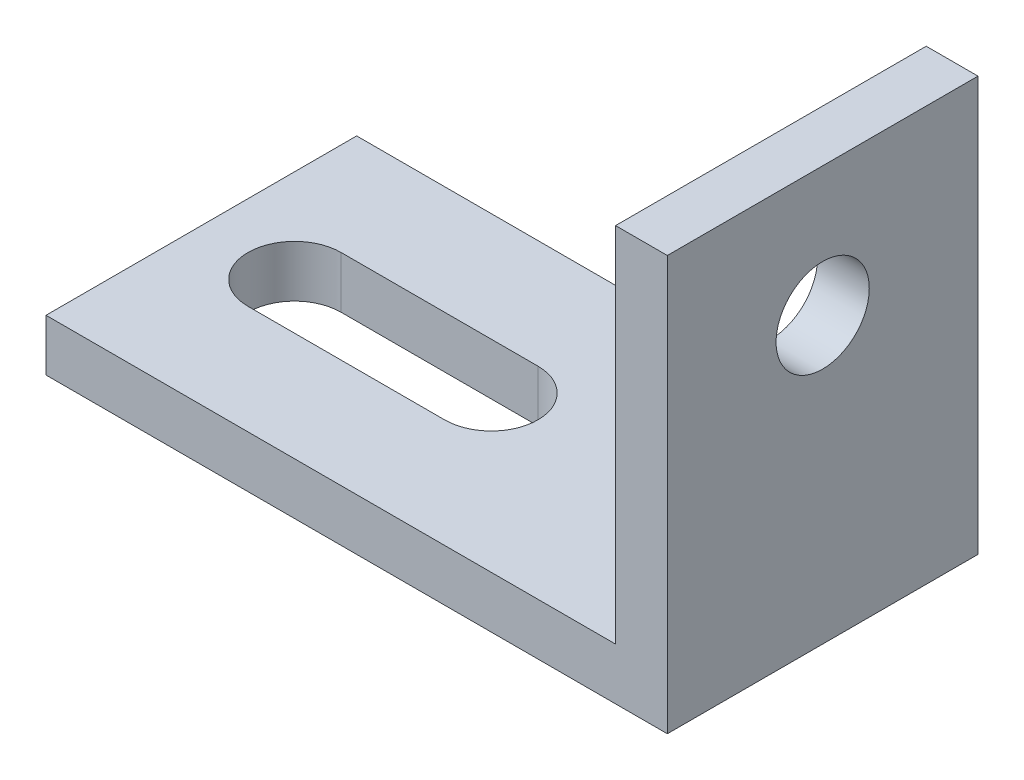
ISO-10303-21;
HEADER;
FILE_DESCRIPTION(('STEP AP214'),'2;1');
FILE_NAME('part.step','',(''),(''),'','','');
FILE_SCHEMA(('AUTOMOTIVE_DESIGN { 1 0 10303 214 1 1 1 1 }'));
ENDSEC;
DATA;
#1=APPLICATION_CONTEXT('core data for automotive mechanical design processes');
#2=APPLICATION_PROTOCOL_DEFINITION('international standard','automotive_design',2000,#1);
#3=PRODUCT_CONTEXT('',#1,'mechanical');
#4=PRODUCT('Part','Part','',(#3));
#5=PRODUCT_RELATED_PRODUCT_CATEGORY('part','',(#4));
#6=PRODUCT_DEFINITION_FORMATION('','',#4);
#7=PRODUCT_DEFINITION_CONTEXT('part definition',#1,'design');
#8=PRODUCT_DEFINITION('design','',#6,#7);
#9=PRODUCT_DEFINITION_SHAPE('','',#8);
#10=(LENGTH_UNIT() NAMED_UNIT(*) SI_UNIT(.MILLI.,.METRE.));
#11=(NAMED_UNIT(*) PLANE_ANGLE_UNIT() SI_UNIT($,.RADIAN.));
#12=(NAMED_UNIT(*) SI_UNIT($,.STERADIAN.) SOLID_ANGLE_UNIT());
#13=UNCERTAINTY_MEASURE_WITH_UNIT(LENGTH_MEASURE(1.E-05),#10,'distance_accuracy_value','');
#14=(GEOMETRIC_REPRESENTATION_CONTEXT(3) GLOBAL_UNCERTAINTY_ASSIGNED_CONTEXT((#13)) GLOBAL_UNIT_ASSIGNED_CONTEXT((#10,
#11,#12)) REPRESENTATION_CONTEXT('',''));
#15=CARTESIAN_POINT('',(0.,0.,0.));
#16=DIRECTION('',(0.,0.,1.));
#17=DIRECTION('',(1.,0.,0.));
#18=AXIS2_PLACEMENT_3D('',#15,#16,#17);
#19=CARTESIAN_POINT('',(2.5,0.,0.));
#20=DIRECTION('',(1.,0.,0.));
#21=DIRECTION('',(0.,0.,-1.));
#22=AXIS2_PLACEMENT_3D('',#19,#20,#21);
#23=CYLINDRICAL_SURFACE('',#22,4.5);
#24=CARTESIAN_POINT('',(0.,0.,0.));
#25=DIRECTION('',(1.,0.,0.));
#26=DIRECTION('',(0.,0.,-1.));
#27=AXIS2_PLACEMENT_3D('',#24,#25,#26);
#28=CIRCLE('',#27,4.5);
#29=CARTESIAN_POINT('',(0.,0.,-4.50000000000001));
#30=VERTEX_POINT('',#29);
#31=EDGE_CURVE('E18',#30,#30,#28,.F.);
#32=ORIENTED_EDGE('',*,*,#31,.T.);
#33=EDGE_LOOP('',(#32));
#34=FACE_BOUND('',#33,.T.);
#35=CARTESIAN_POINT('',(5.,0.,0.));
#36=DIRECTION('',(1.,0.,0.));
#37=DIRECTION('',(0.,0.,-1.));
#38=AXIS2_PLACEMENT_3D('',#35,#36,#37);
#39=CIRCLE('',#38,4.5);
#40=CARTESIAN_POINT('',(5.,0.,-4.50000000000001));
#41=VERTEX_POINT('',#40);
#42=EDGE_CURVE('E137',#41,#41,#39,.T.);
#43=ORIENTED_EDGE('',*,*,#42,.T.);
#44=EDGE_LOOP('',(#43));
#45=FACE_BOUND('',#44,.T.);
#46=ADVANCED_FACE('F15',(#34,#45),#23,.F.);
#47=CARTESIAN_POINT('',(2.5,12.5,0.));
#48=DIRECTION('',(0.,1.,0.));
#49=DIRECTION('',(0.,0.,1.));
#50=AXIS2_PLACEMENT_3D('',#47,#48,#49);
#51=PLANE('',#50);
#52=DIRECTION('',(-1.,0.,0.));
#53=VECTOR('',#52,1.);
#54=CARTESIAN_POINT('',(2.5,12.5,15.));
#55=LINE('',#54,#53);
#56=CARTESIAN_POINT('',(0.,12.5,15.));
#57=VERTEX_POINT('',#56);
#58=CARTESIAN_POINT('',(5.,12.5,15.));
#59=VERTEX_POINT('',#58);
#60=EDGE_CURVE('E151',#57,#59,#55,.F.);
#61=ORIENTED_EDGE('',*,*,#60,.T.);
#62=DIRECTION('',(0.,0.,1.));
#63=VECTOR('',#62,1.);
#64=CARTESIAN_POINT('',(5.,12.5,0.));
#65=LINE('',#64,#63);
#66=CARTESIAN_POINT('',(5.,12.5,-15.));
#67=VERTEX_POINT('',#66);
#68=EDGE_CURVE('E139',#59,#67,#65,.F.);
#69=ORIENTED_EDGE('',*,*,#68,.T.);
#70=DIRECTION('',(1.,0.,0.));
#71=VECTOR('',#70,1.);
#72=CARTESIAN_POINT('',(2.5,12.5,-15.));
#73=LINE('',#72,#71);
#74=CARTESIAN_POINT('',(0.,12.5,-15.));
#75=VERTEX_POINT('',#74);
#76=EDGE_CURVE('E283',#67,#75,#73,.F.);
#77=ORIENTED_EDGE('',*,*,#76,.T.);
#78=DIRECTION('',(0.,0.,-1.));
#79=VECTOR('',#78,1.);
#80=CARTESIAN_POINT('',(0.,12.5,0.));
#81=LINE('',#80,#79);
#82=EDGE_CURVE('E68',#75,#57,#81,.F.);
#83=ORIENTED_EDGE('',*,*,#82,.T.);
#84=EDGE_LOOP('',(#61,#69,#77,#83));
#85=FACE_BOUND('',#84,.T.);
#86=ADVANCED_FACE('F157',(#85),#51,.T.);
#87=CARTESIAN_POINT('',(0.,-7.5,0.));
#88=DIRECTION('',(1.,0.,0.));
#89=DIRECTION('',(0.,0.,-1.));
#90=AXIS2_PLACEMENT_3D('',#87,#88,#89);
#91=PLANE('',#90);
#92=ORIENTED_EDGE('',*,*,#31,.F.);
#93=EDGE_LOOP('',(#92));
#94=FACE_BOUND('',#93,.T.);
#95=DIRECTION('',(0.,1.,0.));
#96=VECTOR('',#95,1.);
#97=CARTESIAN_POINT('',(0.,-7.5,15.));
#98=LINE('',#97,#96);
#99=CARTESIAN_POINT('',(0.,-22.5,15.));
#100=VERTEX_POINT('',#99);
#101=EDGE_CURVE('E112',#100,#57,#98,.T.);
#102=ORIENTED_EDGE('',*,*,#101,.T.);
#103=ORIENTED_EDGE('',*,*,#82,.F.);
#104=DIRECTION('',(0.,1.,0.));
#105=VECTOR('',#104,1.);
#106=CARTESIAN_POINT('',(0.,-7.5,-15.));
#107=LINE('',#106,#105);
#108=CARTESIAN_POINT('',(0.,-22.5,-15.));
#109=VERTEX_POINT('',#108);
#110=EDGE_CURVE('E128',#75,#109,#107,.F.);
#111=ORIENTED_EDGE('',*,*,#110,.T.);
#112=DIRECTION('',(0.,0.,1.));
#113=VECTOR('',#112,1.);
#114=CARTESIAN_POINT('',(0.,-22.5,0.));
#115=LINE('',#114,#113);
#116=EDGE_CURVE('E88',#100,#109,#115,.F.);
#117=ORIENTED_EDGE('',*,*,#116,.F.);
#118=EDGE_LOOP('',(#102,#103,#111,#117));
#119=FACE_BOUND('',#118,.T.);
#120=ADVANCED_FACE('F155',(#94,#119),#91,.F.);
#121=CARTESIAN_POINT('',(-25.,-22.5,0.));
#122=DIRECTION('',(0.,1.,0.));
#123=DIRECTION('',(0.,0.,1.));
#124=AXIS2_PLACEMENT_3D('',#121,#122,#123);
#125=PLANE('',#124);
#126=CARTESIAN_POINT('',(-46.,-22.5,0.));
#127=DIRECTION('',(0.,1.,0.));
#128=DIRECTION('',(0.,0.,1.));
#129=AXIS2_PLACEMENT_3D('',#126,#127,#128);
#130=CIRCLE('',#129,4.5);
#131=CARTESIAN_POINT('',(-46.,-22.5,4.5));
#132=VERTEX_POINT('',#131);
#133=CARTESIAN_POINT('',(-46.,-22.5,-4.50000000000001));
#134=VERTEX_POINT('',#133);
#135=EDGE_CURVE('E136',#132,#134,#130,.F.);
#136=ORIENTED_EDGE('',*,*,#135,.T.);
#137=DIRECTION('',(-1.,0.,0.));
#138=VECTOR('',#137,1.);
#139=CARTESIAN_POINT('',(-46.,-22.5,-4.50000000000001));
#140=LINE('',#139,#138);
#141=CARTESIAN_POINT('',(-27.,-22.5,-4.5));
#142=VERTEX_POINT('',#141);
#143=EDGE_CURVE('E122',#134,#142,#140,.F.);
#144=ORIENTED_EDGE('',*,*,#143,.T.);
#145=CARTESIAN_POINT('',(-27.,-22.5,0.));
#146=DIRECTION('',(0.,1.,0.));
#147=DIRECTION('',(0.,0.,1.));
#148=AXIS2_PLACEMENT_3D('',#145,#146,#147);
#149=CIRCLE('',#148,4.5);
#150=CARTESIAN_POINT('',(-27.,-22.5,4.5));
#151=VERTEX_POINT('',#150);
#152=EDGE_CURVE('E134',#142,#151,#149,.F.);
#153=ORIENTED_EDGE('',*,*,#152,.T.);
#154=DIRECTION('',(1.,0.,0.));
#155=VECTOR('',#154,1.);
#156=CARTESIAN_POINT('',(-27.,-22.5,4.5));
#157=LINE('',#156,#155);
#158=EDGE_CURVE('E59',#151,#132,#157,.F.);
#159=ORIENTED_EDGE('',*,*,#158,.T.);
#160=EDGE_LOOP('',(#136,#144,#153,#159));
#161=FACE_BOUND('',#160,.T.);
#162=DIRECTION('',(0.,0.,-1.));
#163=VECTOR('',#162,1.);
#164=CARTESIAN_POINT('',(-55.,-22.5,0.));
#165=LINE('',#164,#163);
#166=CARTESIAN_POINT('',(-55.,-22.5,-15.));
#167=VERTEX_POINT('',#166);
#168=CARTESIAN_POINT('',(-55.,-22.5,15.));
#169=VERTEX_POINT('',#168);
#170=EDGE_CURVE('E94',#167,#169,#165,.F.);
#171=ORIENTED_EDGE('',*,*,#170,.T.);
#172=DIRECTION('',(-1.,0.,0.));
#173=VECTOR('',#172,1.);
#174=CARTESIAN_POINT('',(2.5,-22.5,15.));
#175=LINE('',#174,#173);
#176=EDGE_CURVE('E97',#169,#100,#175,.F.);
#177=ORIENTED_EDGE('',*,*,#176,.T.);
#178=ORIENTED_EDGE('',*,*,#116,.T.);
#179=DIRECTION('',(1.,0.,0.));
#180=VECTOR('',#179,1.);
#181=CARTESIAN_POINT('',(2.5,-22.5,-15.));
#182=LINE('',#181,#180);
#183=EDGE_CURVE('E99',#109,#167,#182,.F.);
#184=ORIENTED_EDGE('',*,*,#183,.T.);
#185=EDGE_LOOP('',(#171,#177,#178,#184));
#186=FACE_BOUND('',#185,.T.);
#187=ADVANCED_FACE('F96',(#161,#186),#125,.T.);
#188=CARTESIAN_POINT('',(-55.,-25.,0.));
#189=DIRECTION('',(1.,0.,0.));
#190=DIRECTION('',(0.,0.,-1.));
#191=AXIS2_PLACEMENT_3D('',#188,#189,#190);
#192=PLANE('',#191);
#193=DIRECTION('',(0.,0.,1.));
#194=VECTOR('',#193,1.);
#195=CARTESIAN_POINT('',(-55.,-27.5,0.));
#196=LINE('',#195,#194);
#197=CARTESIAN_POINT('',(-55.,-27.5,-15.));
#198=VERTEX_POINT('',#197);
#199=CARTESIAN_POINT('',(-55.,-27.5,15.));
#200=VERTEX_POINT('',#199);
#201=EDGE_CURVE('E117',#198,#200,#196,.T.);
#202=ORIENTED_EDGE('',*,*,#201,.T.);
#203=DIRECTION('',(0.,1.,0.));
#204=VECTOR('',#203,1.);
#205=CARTESIAN_POINT('',(-55.,-7.5,15.));
#206=LINE('',#205,#204);
#207=EDGE_CURVE('E104',#200,#169,#206,.T.);
#208=ORIENTED_EDGE('',*,*,#207,.T.);
#209=ORIENTED_EDGE('',*,*,#170,.F.);
#210=DIRECTION('',(0.,1.,0.));
#211=VECTOR('',#210,1.);
#212=CARTESIAN_POINT('',(-55.,-7.5,-15.));
#213=LINE('',#212,#211);
#214=EDGE_CURVE('E142',#167,#198,#213,.F.);
#215=ORIENTED_EDGE('',*,*,#214,.T.);
#216=EDGE_LOOP('',(#202,#208,#209,#215));
#217=FACE_BOUND('',#216,.T.);
#218=ADVANCED_FACE('F115',(#217),#192,.F.);
#219=CARTESIAN_POINT('',(2.5,-7.5,15.));
#220=DIRECTION('',(0.,0.,-1.));
#221=DIRECTION('',(-1.,0.,0.));
#222=AXIS2_PLACEMENT_3D('',#219,#220,#221);
#223=PLANE('',#222);
#224=ORIENTED_EDGE('',*,*,#60,.F.);
#225=ORIENTED_EDGE('',*,*,#101,.F.);
#226=ORIENTED_EDGE('',*,*,#176,.F.);
#227=ORIENTED_EDGE('',*,*,#207,.F.);
#228=DIRECTION('',(1.,0.,0.));
#229=VECTOR('',#228,1.);
#230=CARTESIAN_POINT('',(2.5,-27.5,15.));
#231=LINE('',#230,#229);
#232=CARTESIAN_POINT('',(5.,-27.5,15.));
#233=VERTEX_POINT('',#232);
#234=EDGE_CURVE('E266',#200,#233,#231,.T.);
#235=ORIENTED_EDGE('',*,*,#234,.T.);
#236=DIRECTION('',(0.,1.,0.));
#237=VECTOR('',#236,1.);
#238=CARTESIAN_POINT('',(5.,-7.5,15.));
#239=LINE('',#238,#237);
#240=EDGE_CURVE('E144',#233,#59,#239,.T.);
#241=ORIENTED_EDGE('',*,*,#240,.T.);
#242=EDGE_LOOP('',(#224,#225,#226,#227,#235,#241));
#243=FACE_BOUND('',#242,.T.);
#244=ADVANCED_FACE('F109',(#243),#223,.F.);
#245=CARTESIAN_POINT('',(5.,-7.5,0.));
#246=DIRECTION('',(-1.,0.,0.));
#247=DIRECTION('',(0.,0.,1.));
#248=AXIS2_PLACEMENT_3D('',#245,#246,#247);
#249=PLANE('',#248);
#250=ORIENTED_EDGE('',*,*,#42,.F.);
#251=EDGE_LOOP('',(#250));
#252=FACE_BOUND('',#251,.T.);
#253=ORIENTED_EDGE('',*,*,#68,.F.);
#254=ORIENTED_EDGE('',*,*,#240,.F.);
#255=DIRECTION('',(0.,0.,1.));
#256=VECTOR('',#255,1.);
#257=CARTESIAN_POINT('',(5.,-27.5,0.));
#258=LINE('',#257,#256);
#259=CARTESIAN_POINT('',(5.,-27.5,-15.));
#260=VERTEX_POINT('',#259);
#261=EDGE_CURVE('E268',#233,#260,#258,.F.);
#262=ORIENTED_EDGE('',*,*,#261,.T.);
#263=DIRECTION('',(0.,1.,0.));
#264=VECTOR('',#263,1.);
#265=CARTESIAN_POINT('',(5.,-7.5,-15.));
#266=LINE('',#265,#264);
#267=EDGE_CURVE('E265',#260,#67,#266,.T.);
#268=ORIENTED_EDGE('',*,*,#267,.T.);
#269=EDGE_LOOP('',(#253,#254,#262,#268));
#270=FACE_BOUND('',#269,.T.);
#271=ADVANCED_FACE('F194',(#252,#270),#249,.F.);
#272=CARTESIAN_POINT('',(2.5,-7.5,-15.));
#273=DIRECTION('',(0.,0.,1.));
#274=DIRECTION('',(1.,0.,0.));
#275=AXIS2_PLACEMENT_3D('',#272,#273,#274);
#276=PLANE('',#275);
#277=ORIENTED_EDGE('',*,*,#76,.F.);
#278=ORIENTED_EDGE('',*,*,#267,.F.);
#279=DIRECTION('',(1.,0.,0.));
#280=VECTOR('',#279,1.);
#281=CARTESIAN_POINT('',(2.5,-27.5,-15.));
#282=LINE('',#281,#280);
#283=EDGE_CURVE('E270',#260,#198,#282,.F.);
#284=ORIENTED_EDGE('',*,*,#283,.T.);
#285=ORIENTED_EDGE('',*,*,#214,.F.);
#286=ORIENTED_EDGE('',*,*,#183,.F.);
#287=ORIENTED_EDGE('',*,*,#110,.F.);
#288=EDGE_LOOP('',(#277,#278,#284,#285,#286,#287));
#289=FACE_BOUND('',#288,.T.);
#290=ADVANCED_FACE('F190',(#289),#276,.F.);
#291=CARTESIAN_POINT('',(-27.,-27.5,4.5));
#292=DIRECTION('',(0.,0.,1.));
#293=DIRECTION('',(1.,0.,0.));
#294=AXIS2_PLACEMENT_3D('',#291,#292,#293);
#295=PLANE('',#294);
#296=DIRECTION('',(0.,1.,0.));
#297=VECTOR('',#296,1.);
#298=CARTESIAN_POINT('',(-27.,-27.5,4.5));
#299=LINE('',#298,#297);
#300=CARTESIAN_POINT('',(-27.,-27.5,4.5));
#301=VERTEX_POINT('',#300);
#302=EDGE_CURVE('E124',#151,#301,#299,.F.);
#303=ORIENTED_EDGE('',*,*,#302,.T.);
#304=DIRECTION('',(1.,0.,0.));
#305=VECTOR('',#304,1.);
#306=CARTESIAN_POINT('',(2.5,-27.5,4.5));
#307=LINE('',#306,#305);
#308=CARTESIAN_POINT('',(-46.,-27.5,4.5));
#309=VERTEX_POINT('',#308);
#310=EDGE_CURVE('E133',#301,#309,#307,.F.);
#311=ORIENTED_EDGE('',*,*,#310,.T.);
#312=DIRECTION('',(0.,1.,0.));
#313=VECTOR('',#312,1.);
#314=CARTESIAN_POINT('',(-46.,-27.5,4.5));
#315=LINE('',#314,#313);
#316=EDGE_CURVE('E127',#309,#132,#315,.T.);
#317=ORIENTED_EDGE('',*,*,#316,.T.);
#318=ORIENTED_EDGE('',*,*,#158,.F.);
#319=EDGE_LOOP('',(#303,#311,#317,#318));
#320=FACE_BOUND('',#319,.T.);
#321=ADVANCED_FACE('F186',(#320),#295,.F.);
#322=CARTESIAN_POINT('',(-46.,-27.5,0.));
#323=DIRECTION('',(0.,1.,0.));
#324=DIRECTION('',(0.,0.,1.));
#325=AXIS2_PLACEMENT_3D('',#322,#323,#324);
#326=CYLINDRICAL_SURFACE('',#325,4.5);
#327=ORIENTED_EDGE('',*,*,#316,.F.);
#328=CARTESIAN_POINT('',(-46.,-27.5,0.));
#329=DIRECTION('',(0.,1.,0.));
#330=DIRECTION('',(0.,0.,1.));
#331=AXIS2_PLACEMENT_3D('',#328,#329,#330);
#332=CIRCLE('',#331,4.5);
#333=CARTESIAN_POINT('',(-46.,-27.5,-4.50000000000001));
#334=VERTEX_POINT('',#333);
#335=EDGE_CURVE('E130',#309,#334,#332,.F.);
#336=ORIENTED_EDGE('',*,*,#335,.T.);
#337=DIRECTION('',(0.,1.,0.));
#338=VECTOR('',#337,1.);
#339=CARTESIAN_POINT('',(-46.,-27.5,-4.50000000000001));
#340=LINE('',#339,#338);
#341=EDGE_CURVE('E125',#334,#134,#340,.T.);
#342=ORIENTED_EDGE('',*,*,#341,.T.);
#343=ORIENTED_EDGE('',*,*,#135,.F.);
#344=EDGE_LOOP('',(#327,#336,#342,#343));
#345=FACE_BOUND('',#344,.T.);
#346=ADVANCED_FACE('F182',(#345),#326,.F.);
#347=CARTESIAN_POINT('',(-46.,-27.5,-4.50000000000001));
#348=DIRECTION('',(0.,0.,-1.));
#349=DIRECTION('',(-1.,0.,0.));
#350=AXIS2_PLACEMENT_3D('',#347,#348,#349);
#351=PLANE('',#350);
#352=ORIENTED_EDGE('',*,*,#341,.F.);
#353=DIRECTION('',(1.,0.,0.));
#354=VECTOR('',#353,1.);
#355=CARTESIAN_POINT('',(2.5,-27.5,-4.50000000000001));
#356=LINE('',#355,#354);
#357=CARTESIAN_POINT('',(-27.,-27.5,-4.5));
#358=VERTEX_POINT('',#357);
#359=EDGE_CURVE('E24',#334,#358,#356,.T.);
#360=ORIENTED_EDGE('',*,*,#359,.T.);
#361=DIRECTION('',(0.,1.,0.));
#362=VECTOR('',#361,1.);
#363=CARTESIAN_POINT('',(-27.,-27.5,-4.5));
#364=LINE('',#363,#362);
#365=EDGE_CURVE('E32',#358,#142,#364,.T.);
#366=ORIENTED_EDGE('',*,*,#365,.T.);
#367=ORIENTED_EDGE('',*,*,#143,.F.);
#368=EDGE_LOOP('',(#352,#360,#366,#367));
#369=FACE_BOUND('',#368,.T.);
#370=ADVANCED_FACE('F175',(#369),#351,.F.);
#371=CARTESIAN_POINT('',(-27.,-27.5,0.));
#372=DIRECTION('',(0.,1.,0.));
#373=DIRECTION('',(0.,0.,1.));
#374=AXIS2_PLACEMENT_3D('',#371,#372,#373);
#375=CYLINDRICAL_SURFACE('',#374,4.5);
#376=ORIENTED_EDGE('',*,*,#365,.F.);
#377=CARTESIAN_POINT('',(-27.,-27.5,0.));
#378=DIRECTION('',(0.,1.,0.));
#379=DIRECTION('',(0.,0.,1.));
#380=AXIS2_PLACEMENT_3D('',#377,#378,#379);
#381=CIRCLE('',#380,4.5);
#382=EDGE_CURVE('E10',#358,#301,#381,.F.);
#383=ORIENTED_EDGE('',*,*,#382,.T.);
#384=ORIENTED_EDGE('',*,*,#302,.F.);
#385=ORIENTED_EDGE('',*,*,#152,.F.);
#386=EDGE_LOOP('',(#376,#383,#384,#385));
#387=FACE_BOUND('',#386,.T.);
#388=ADVANCED_FACE('F169',(#387),#375,.F.);
#389=CARTESIAN_POINT('',(2.5,-27.5,0.));
#390=DIRECTION('',(0.,1.,0.));
#391=DIRECTION('',(0.,0.,1.));
#392=AXIS2_PLACEMENT_3D('',#389,#390,#391);
#393=PLANE('',#392);
#394=ORIENTED_EDGE('',*,*,#359,.F.);
#395=ORIENTED_EDGE('',*,*,#335,.F.);
#396=ORIENTED_EDGE('',*,*,#310,.F.);
#397=ORIENTED_EDGE('',*,*,#382,.F.);
#398=EDGE_LOOP('',(#394,#395,#396,#397));
#399=FACE_BOUND('',#398,.T.);
#400=ORIENTED_EDGE('',*,*,#261,.F.);
#401=ORIENTED_EDGE('',*,*,#234,.F.);
#402=ORIENTED_EDGE('',*,*,#201,.F.);
#403=ORIENTED_EDGE('',*,*,#283,.F.);
#404=EDGE_LOOP('',(#400,#401,#402,#403));
#405=FACE_BOUND('',#404,.T.);
#406=ADVANCED_FACE('F167',(#399,#405),#393,.F.);
#407=CLOSED_SHELL('',(#46,#86,#120,#187,#218,#244,#271,#290,#321,#346,#370,#388,#406));
#408=MANIFOLD_SOLID_BREP('B1',#407);
#409=ADVANCED_BREP_SHAPE_REPRESENTATION('',(#18,#408),#14);
#410=SHAPE_DEFINITION_REPRESENTATION(#9,#409);
ENDSEC;
END-ISO-10303-21;
